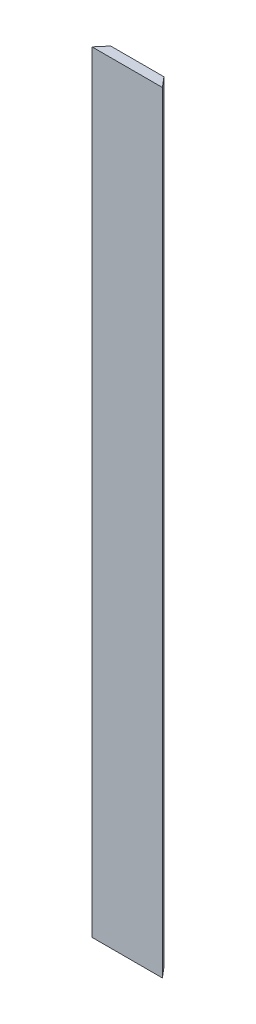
from build123d import *

# Parameters (mm, degrees)
BOSS_EXTRUDE1_DEPTH = 1219.2


with BuildPart() as part:
    # Sketch1 → Boss-Extrude1 (new body)
    with BuildSketch(Plane(origin=(0, 0, 0), x_dir=(1, 0, 0), z_dir=(0, 1, 0))):
        Polygon((0, 0), (111.125, 0), (97.63125, 15.875), (13.49375, 15.875), align=None)
    extrude(amount=BOSS_EXTRUDE1_DEPTH)


solid = part.part
